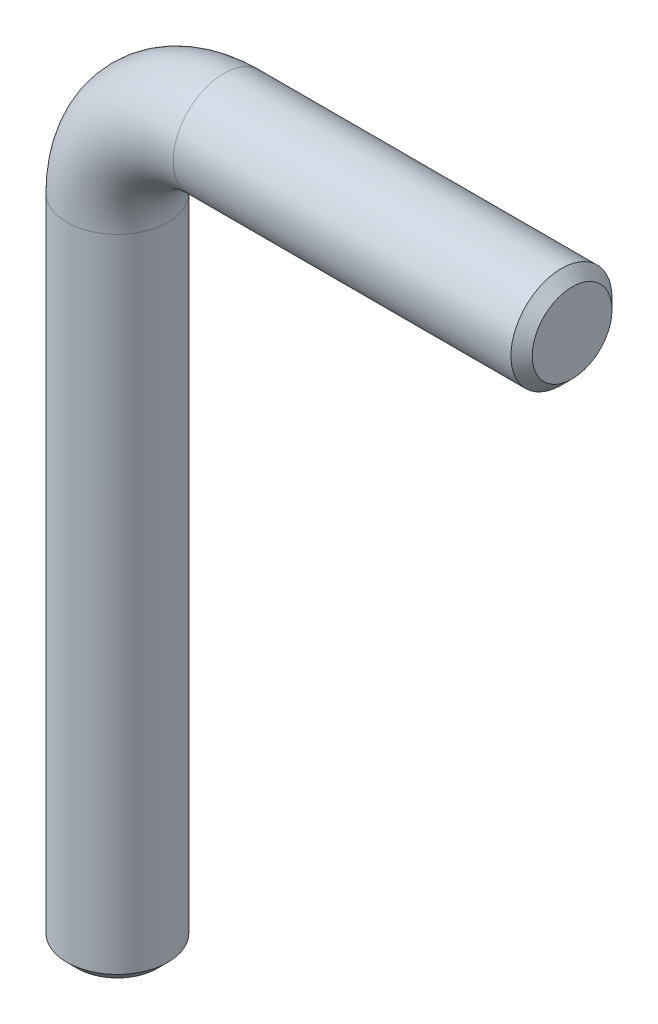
ISO-10303-21;
HEADER;
FILE_DESCRIPTION(('STEP AP214'),'2;1');
FILE_NAME('part.step','',(''),(''),'','','');
FILE_SCHEMA(('AUTOMOTIVE_DESIGN { 1 0 10303 214 1 1 1 1 }'));
ENDSEC;
DATA;
#1=APPLICATION_CONTEXT('core data for automotive mechanical design processes');
#2=APPLICATION_PROTOCOL_DEFINITION('international standard','automotive_design',2000,#1);
#3=PRODUCT_CONTEXT('',#1,'mechanical');
#4=PRODUCT('Part','Part','',(#3));
#5=PRODUCT_RELATED_PRODUCT_CATEGORY('part','',(#4));
#6=PRODUCT_DEFINITION_FORMATION('','',#4);
#7=PRODUCT_DEFINITION_CONTEXT('part definition',#1,'design');
#8=PRODUCT_DEFINITION('design','',#6,#7);
#9=PRODUCT_DEFINITION_SHAPE('','',#8);
#10=(LENGTH_UNIT() NAMED_UNIT(*) SI_UNIT(.MILLI.,.METRE.));
#11=(NAMED_UNIT(*) PLANE_ANGLE_UNIT() SI_UNIT($,.RADIAN.));
#12=(NAMED_UNIT(*) SI_UNIT($,.STERADIAN.) SOLID_ANGLE_UNIT());
#13=UNCERTAINTY_MEASURE_WITH_UNIT(LENGTH_MEASURE(1.E-05),#10,'distance_accuracy_value','');
#14=(GEOMETRIC_REPRESENTATION_CONTEXT(3) GLOBAL_UNCERTAINTY_ASSIGNED_CONTEXT((#13)) GLOBAL_UNIT_ASSIGNED_CONTEXT((#10,
#11,#12)) REPRESENTATION_CONTEXT('',''));
#15=CARTESIAN_POINT('',(0.,0.,0.));
#16=DIRECTION('',(0.,0.,1.));
#17=DIRECTION('',(1.,0.,0.));
#18=AXIS2_PLACEMENT_3D('',#15,#16,#17);
#19=CARTESIAN_POINT('',(10.,71.25,0.));
#20=DIRECTION('',(1.,0.,0.));
#21=DIRECTION('',(0.,1.,0.));
#22=AXIS2_PLACEMENT_3D('',#19,#20,#21);
#23=CYLINDRICAL_SURFACE('',#22,4.75);
#24=CARTESIAN_POINT('',(41.75,71.25,0.));
#25=DIRECTION('',(1.,0.,0.));
#26=DIRECTION('',(0.,0.,-1.));
#27=AXIS2_PLACEMENT_3D('',#24,#25,#26);
#28=CIRCLE('',#27,4.75);
#29=CARTESIAN_POINT('',(41.75,71.25,-4.75));
#30=VERTEX_POINT('',#29);
#31=EDGE_CURVE('E10',#30,#30,#28,.F.);
#32=ORIENTED_EDGE('',*,*,#31,.T.);
#33=EDGE_LOOP('',(#32));
#34=FACE_BOUND('',#33,.T.);
#35=CARTESIAN_POINT('',(10.,71.25,0.));
#36=DIRECTION('',(1.,0.,0.));
#37=DIRECTION('',(0.,0.,1.));
#38=AXIS2_PLACEMENT_3D('',#35,#36,#37);
#39=CIRCLE('',#38,4.75);
#40=CARTESIAN_POINT('',(10.,76.,0.));
#41=VERTEX_POINT('',#40);
#42=EDGE_CURVE('E53',#41,#41,#39,.T.);
#43=ORIENTED_EDGE('',*,*,#42,.T.);
#44=EDGE_LOOP('',(#43));
#45=FACE_BOUND('',#44,.T.);
#46=ADVANCED_FACE('F33',(#34,#45),#23,.T.);
#47=CARTESIAN_POINT('',(10.,61.25,0.));
#48=DIRECTION('',(0.,0.,-1.));
#49=DIRECTION('',(-1.,0.,0.));
#50=AXIS2_PLACEMENT_3D('',#47,#48,#49);
#51=TOROIDAL_SURFACE('',#50,10.,4.75);
#52=CARTESIAN_POINT('',(0.,61.25,0.));
#53=DIRECTION('',(0.,1.,0.));
#54=DIRECTION('',(0.,0.,1.));
#55=AXIS2_PLACEMENT_3D('',#52,#53,#54);
#56=CIRCLE('',#55,4.75);
#57=CARTESIAN_POINT('',(-4.75,61.25,0.));
#58=VERTEX_POINT('',#57);
#59=EDGE_CURVE('E56',#58,#58,#56,.T.);
#60=CARTESIAN_POINT('',(10.,61.25,0.));
#61=DIRECTION('',(0.,0.,-1.));
#62=DIRECTION('',(-1.,0.,0.));
#63=AXIS2_PLACEMENT_3D('',#60,#61,#62);
#64=CIRCLE('',#63,14.75);
#65=EDGE_CURVE('',#58,#41,#64,.T.);
#66=ORIENTED_EDGE('',*,*,#59,.T.);
#67=ORIENTED_EDGE('',*,*,#42,.F.);
#68=ORIENTED_EDGE('',*,*,#65,.T.);
#69=ORIENTED_EDGE('',*,*,#65,.F.);
#70=EDGE_LOOP('',(#66,#68,#67,#69));
#71=FACE_BOUND('',#70,.T.);
#72=ADVANCED_FACE('F60',(#71),#51,.T.);
#73=CARTESIAN_POINT('',(0.,61.25,0.));
#74=DIRECTION('',(0.,-1.,0.));
#75=DIRECTION('',(0.,0.,-1.));
#76=AXIS2_PLACEMENT_3D('',#73,#74,#75);
#77=CYLINDRICAL_SURFACE('',#76,4.75);
#78=CARTESIAN_POINT('',(0.,0.999999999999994,0.));
#79=DIRECTION('',(0.,1.,0.));
#80=DIRECTION('',(0.,0.,1.));
#81=AXIS2_PLACEMENT_3D('',#78,#79,#80);
#82=CIRCLE('',#81,4.75);
#83=CARTESIAN_POINT('',(0.,0.999999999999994,4.75));
#84=VERTEX_POINT('',#83);
#85=EDGE_CURVE('E48',#84,#84,#82,.T.);
#86=ORIENTED_EDGE('',*,*,#85,.T.);
#87=EDGE_LOOP('',(#86));
#88=FACE_BOUND('',#87,.T.);
#89=ORIENTED_EDGE('',*,*,#59,.F.);
#90=EDGE_LOOP('',(#89));
#91=FACE_BOUND('',#90,.T.);
#92=ADVANCED_FACE('F63',(#88,#91),#77,.T.);
#93=CARTESIAN_POINT('',(42.75,71.25,0.));
#94=DIRECTION('',(1.,0.,0.));
#95=DIRECTION('',(0.,0.,1.));
#96=AXIS2_PLACEMENT_3D('',#93,#94,#95);
#97=PLANE('',#96);
#98=CARTESIAN_POINT('',(42.75,71.25,0.));
#99=DIRECTION('',(1.,0.,0.));
#100=DIRECTION('',(0.,1.,0.));
#101=AXIS2_PLACEMENT_3D('',#98,#99,#100);
#102=CIRCLE('',#101,3.75);
#103=CARTESIAN_POINT('',(42.75,75.,0.));
#104=VERTEX_POINT('',#103);
#105=EDGE_CURVE('E40',#104,#104,#102,.T.);
#106=ORIENTED_EDGE('',*,*,#105,.T.);
#107=EDGE_LOOP('',(#106));
#108=FACE_BOUND('',#107,.T.);
#109=ADVANCED_FACE('F65',(#108),#97,.T.);
#110=CARTESIAN_POINT('',(0.,0.,0.));
#111=DIRECTION('',(0.,1.,0.));
#112=DIRECTION('',(0.,0.,1.));
#113=AXIS2_PLACEMENT_3D('',#110,#111,#112);
#114=PLANE('',#113);
#115=CARTESIAN_POINT('',(0.,0.,0.));
#116=DIRECTION('',(0.,1.,0.));
#117=DIRECTION('',(0.,0.,1.));
#118=AXIS2_PLACEMENT_3D('',#115,#116,#117);
#119=CIRCLE('',#118,3.75000000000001);
#120=CARTESIAN_POINT('',(0.,0.,3.75000000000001));
#121=VERTEX_POINT('',#120);
#122=EDGE_CURVE('E44',#121,#121,#119,.F.);
#123=ORIENTED_EDGE('',*,*,#122,.T.);
#124=EDGE_LOOP('',(#123));
#125=FACE_BOUND('',#124,.T.);
#126=ADVANCED_FACE('F72',(#125),#114,.F.);
#127=CARTESIAN_POINT('',(0.,0.999999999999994,0.));
#128=DIRECTION('',(0.,1.,0.));
#129=DIRECTION('',(0.,0.,1.));
#130=AXIS2_PLACEMENT_3D('',#127,#128,#129);
#131=CONICAL_SURFACE('',#130,4.75,0.785398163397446);
#132=ORIENTED_EDGE('',*,*,#122,.F.);
#133=EDGE_LOOP('',(#132));
#134=FACE_BOUND('',#133,.T.);
#135=ORIENTED_EDGE('',*,*,#85,.F.);
#136=EDGE_LOOP('',(#135));
#137=FACE_BOUND('',#136,.T.);
#138=ADVANCED_FACE('F82',(#134,#137),#131,.T.);
#139=CARTESIAN_POINT('',(42.75,71.25,0.));
#140=DIRECTION('',(-1.,0.,0.));
#141=DIRECTION('',(0.,0.,1.));
#142=AXIS2_PLACEMENT_3D('',#139,#140,#141);
#143=CONICAL_SURFACE('',#142,3.75,0.785398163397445);
#144=ORIENTED_EDGE('',*,*,#31,.F.);
#145=EDGE_LOOP('',(#144));
#146=FACE_BOUND('',#145,.T.);
#147=ORIENTED_EDGE('',*,*,#105,.F.);
#148=EDGE_LOOP('',(#147));
#149=FACE_BOUND('',#148,.T.);
#150=ADVANCED_FACE('F35',(#146,#149),#143,.T.);
#151=CLOSED_SHELL('',(#46,#72,#92,#109,#126,#138,#150));
#152=MANIFOLD_SOLID_BREP('B2',#151);
#153=ADVANCED_BREP_SHAPE_REPRESENTATION('',(#18,#152),#14);
#154=SHAPE_DEFINITION_REPRESENTATION(#9,#153);
ENDSEC;
END-ISO-10303-21;
